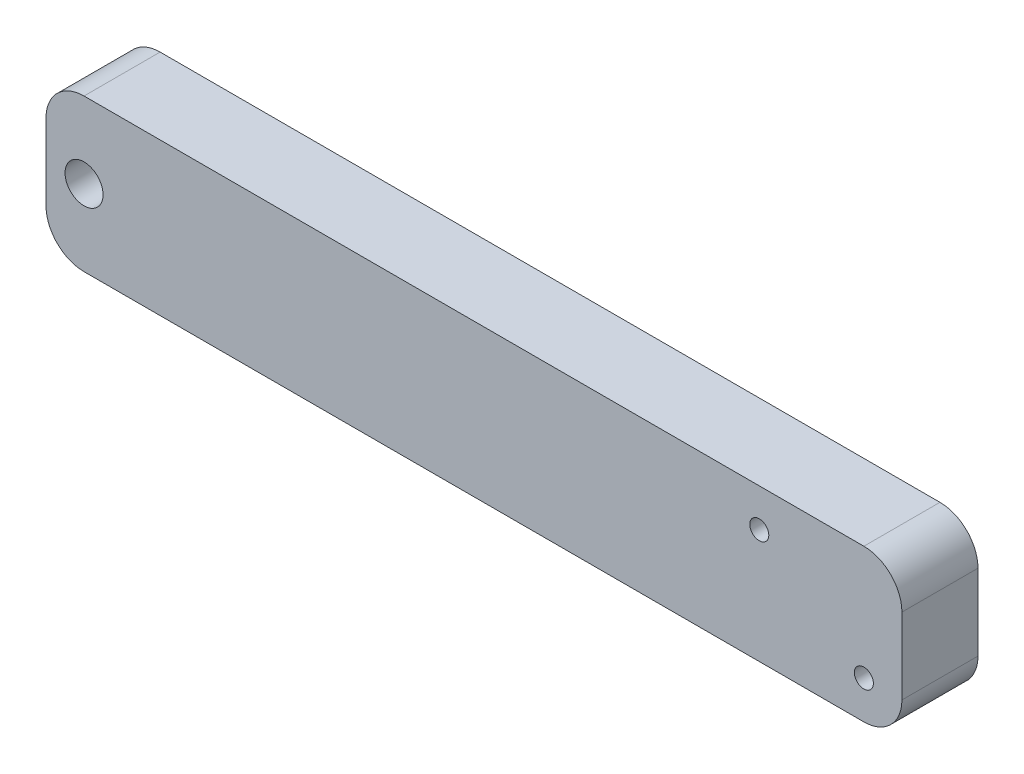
from build123d import *

# Parameters (mm, degrees)
ESQUISSE1_W             = 225
ESQUISSE1_H             = 40
BOSS_EXTRU_1_DEPTH      = 20
CONG_1_R                = 10
ENL_V_MAT_EXTRU_1_REACH = 176.605
ESQUISSE2_R             = 2.5
ESQUISSE2_R_2           = 5


with BuildPart() as part:
    # Esquisse1 → Boss.-Extru.1 (new body)
    with BuildSketch(Plane.XY):
        with Locations((58.45722774, 9.334281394)):
            Rectangle(ESQUISSE1_W, ESQUISSE1_H)
    extrude(amount=BOSS_EXTRU_1_DEPTH)

    # Cong_1
    cong_1_edges = [part.edges().sort_by_distance(p)[0] for p in [
        (-54.04277226, 29.334281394, 10),
        (170.95722774, 29.334281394, 10),
        (170.95722774, -10.665718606, 10),
        (-54.04277226, -10.665718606, 10),
    ]]
    fillet(cong_1_edges, radius=CONG_1_R)

    # Esquisse2 → Enl_v. mat.-Extru.1 (cut, up to next)
    with BuildSketch(Plane(origin=(0, 0, 0), x_dir=(-1, 0, 0), z_dir=(0, 0, -1)), mode=Mode.PRIVATE) as enl_v_mat_extru_1_sk1:
        with Locations((-160.95722774, -0.665718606)):
            Circle(ESQUISSE2_R)
    enl_v_mat_extru_1_tool1 = extrude(enl_v_mat_extru_1_sk1.sketch, amount=-ENL_V_MAT_EXTRU_1_REACH, mode=Mode.PRIVATE) & part.part
    # Esquisse2 → Enl_v. mat.-Extru.1 (cut, up to next)
    with BuildSketch(Plane(origin=(0, 0, 0), x_dir=(-1, 0, 0), z_dir=(0, 0, -1)), mode=Mode.PRIVATE) as enl_v_mat_extru_1_sk2:
        with Locations((-133.46177357, 19.334281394)):
            Circle(ESQUISSE2_R)
    enl_v_mat_extru_1_tool2 = extrude(enl_v_mat_extru_1_sk2.sketch, amount=-ENL_V_MAT_EXTRU_1_REACH, mode=Mode.PRIVATE) & part.part
    # Esquisse2 → Enl_v. mat.-Extru.1 (cut, up to next)
    with BuildSketch(Plane(origin=(0, 0, 0), x_dir=(-1, 0, 0), z_dir=(0, 0, -1)), mode=Mode.PRIVATE) as enl_v_mat_extru_1_sk3:
        with Locations((44.04277226, 9.334281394)):
            Circle(ESQUISSE2_R_2)
    enl_v_mat_extru_1_tool3 = extrude(enl_v_mat_extru_1_sk3.sketch, amount=-ENL_V_MAT_EXTRU_1_REACH, mode=Mode.PRIVATE) & part.part
    add(enl_v_mat_extru_1_tool1.solids().sort_by_distance((160.957228, -0.665719, 0))[0], mode=Mode.SUBTRACT)
    add(enl_v_mat_extru_1_tool2.solids().sort_by_distance((133.461774, 19.334281, 0))[0], mode=Mode.SUBTRACT)
    add(enl_v_mat_extru_1_tool3.solids().sort_by_distance((-44.042772, 9.334281, 0))[0], mode=Mode.SUBTRACT)


solid = part.part
